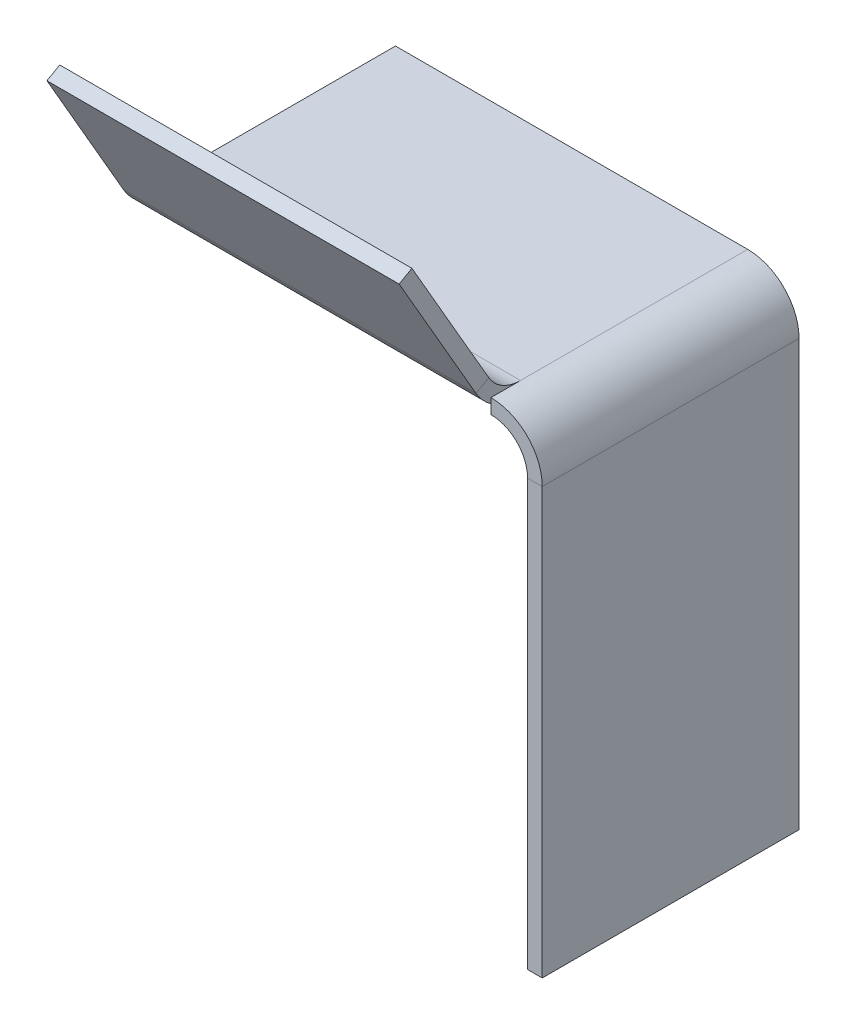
ISO-10303-21;
HEADER;
FILE_DESCRIPTION(('STEP AP214'),'2;1');
FILE_NAME('part.step','',(''),(''),'','','');
FILE_SCHEMA(('AUTOMOTIVE_DESIGN { 1 0 10303 214 1 1 1 1 }'));
ENDSEC;
DATA;
#1=APPLICATION_CONTEXT('core data for automotive mechanical design processes');
#2=APPLICATION_PROTOCOL_DEFINITION('international standard','automotive_design',2000,#1);
#3=PRODUCT_CONTEXT('',#1,'mechanical');
#4=PRODUCT('Part','Part','',(#3));
#5=PRODUCT_RELATED_PRODUCT_CATEGORY('part','',(#4));
#6=PRODUCT_DEFINITION_FORMATION('','',#4);
#7=PRODUCT_DEFINITION_CONTEXT('part definition',#1,'design');
#8=PRODUCT_DEFINITION('design','',#6,#7);
#9=PRODUCT_DEFINITION_SHAPE('','',#8);
#10=(LENGTH_UNIT() NAMED_UNIT(*) SI_UNIT(.MILLI.,.METRE.));
#11=(NAMED_UNIT(*) PLANE_ANGLE_UNIT() SI_UNIT($,.RADIAN.));
#12=(NAMED_UNIT(*) SI_UNIT($,.STERADIAN.) SOLID_ANGLE_UNIT());
#13=UNCERTAINTY_MEASURE_WITH_UNIT(LENGTH_MEASURE(1.E-05),#10,'distance_accuracy_value','');
#14=(GEOMETRIC_REPRESENTATION_CONTEXT(3) GLOBAL_UNCERTAINTY_ASSIGNED_CONTEXT((#13)) GLOBAL_UNIT_ASSIGNED_CONTEXT((#10,
#11,#12)) REPRESENTATION_CONTEXT('',''));
#15=CARTESIAN_POINT('',(0.,0.,0.));
#16=DIRECTION('',(0.,0.,1.));
#17=DIRECTION('',(1.,0.,0.));
#18=AXIS2_PLACEMENT_3D('',#15,#16,#17);
#19=CARTESIAN_POINT('',(-7.,65.,35.));
#20=DIRECTION('',(-1.,0.,0.));
#21=DIRECTION('',(0.,0.,1.));
#22=AXIS2_PLACEMENT_3D('',#19,#20,#21);
#23=PLANE('',#22);
#24=DIRECTION('',(0.,1.,0.));
#25=VECTOR('',#24,1.);
#26=CARTESIAN_POINT('',(-7.,63.,35.));
#27=LINE('',#26,#25);
#28=CARTESIAN_POINT('',(-7.,63.,35.));
#29=VERTEX_POINT('',#28);
#30=CARTESIAN_POINT('',(-7.,64.2845239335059,35.));
#31=VERTEX_POINT('',#30);
#32=EDGE_CURVE('E279',#29,#31,#27,.T.);
#33=ORIENTED_EDGE('',*,*,#32,.T.);
#34=CARTESIAN_POINT('',(-7.,70.,30.9585481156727));
#35=DIRECTION('',(1.,0.,0.));
#36=DIRECTION('',(0.,0.,-1.));
#37=AXIS2_PLACEMENT_3D('',#34,#35,#36);
#38=CIRCLE('',#37,7.);
#39=CARTESIAN_POINT('',(-7.,63.,30.9585481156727));
#40=VERTEX_POINT('',#39);
#41=EDGE_CURVE('E13',#31,#40,#38,.T.);
#42=ORIENTED_EDGE('',*,*,#41,.T.);
#43=DIRECTION('',(0.,0.,-1.));
#44=VECTOR('',#43,1.);
#45=CARTESIAN_POINT('',(-7.,63.,35.));
#46=LINE('',#45,#44);
#47=EDGE_CURVE('E268',#29,#40,#46,.T.);
#48=ORIENTED_EDGE('',*,*,#47,.F.);
#49=EDGE_LOOP('',(#33,#42,#48));
#50=FACE_BOUND('',#49,.T.);
#51=ADVANCED_FACE('F56',(#50),#23,.T.);
#52=CARTESIAN_POINT('',(0.,65.,35.));
#53=DIRECTION('',(0.,-1.,0.));
#54=DIRECTION('',(0.,0.,-1.));
#55=AXIS2_PLACEMENT_3D('',#52,#53,#54);
#56=PLANE('',#55);
#57=DIRECTION('',(1.,0.,0.));
#58=VECTOR('',#57,1.);
#59=CARTESIAN_POINT('',(-7.,65.,30.9585481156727));
#60=LINE('',#59,#58);
#61=CARTESIAN_POINT('',(-7.,65.,30.9585481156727));
#62=VERTEX_POINT('',#61);
#63=CARTESIAN_POINT('',(-55.,65.,30.9585481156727));
#64=VERTEX_POINT('',#63);
#65=EDGE_CURVE('E208',#62,#64,#60,.F.);
#66=ORIENTED_EDGE('',*,*,#65,.F.);
#67=DIRECTION('',(0.,0.,-1.));
#68=VECTOR('',#67,1.);
#69=CARTESIAN_POINT('',(-7.,65.,35.));
#70=LINE('',#69,#68);
#71=CARTESIAN_POINT('',(-7.,65.,0.));
#72=VERTEX_POINT('',#71);
#73=EDGE_CURVE('E231',#62,#72,#70,.T.);
#74=ORIENTED_EDGE('',*,*,#73,.T.);
#75=DIRECTION('',(-1.,0.,0.));
#76=VECTOR('',#75,1.);
#77=CARTESIAN_POINT('',(0.,65.,0.));
#78=LINE('',#77,#76);
#79=CARTESIAN_POINT('',(-55.,65.,0.));
#80=VERTEX_POINT('',#79);
#81=EDGE_CURVE('E215',#72,#80,#78,.T.);
#82=ORIENTED_EDGE('',*,*,#81,.T.);
#83=DIRECTION('',(0.,0.,-1.));
#84=VECTOR('',#83,1.);
#85=CARTESIAN_POINT('',(-55.,65.,35.));
#86=LINE('',#85,#84);
#87=EDGE_CURVE('E273',#64,#80,#86,.T.);
#88=ORIENTED_EDGE('',*,*,#87,.F.);
#89=EDGE_LOOP('',(#66,#74,#82,#88));
#90=FACE_BOUND('',#89,.T.);
#91=ADVANCED_FACE('F323',(#90),#56,.F.);
#92=CARTESIAN_POINT('',(0.,63.,35.));
#93=DIRECTION('',(0.,-1.,0.));
#94=DIRECTION('',(0.,0.,-1.));
#95=AXIS2_PLACEMENT_3D('',#92,#93,#94);
#96=PLANE('',#95);
#97=CARTESIAN_POINT('',(-7.,63.,0.));
#98=VERTEX_POINT('',#97);
#99=EDGE_CURVE('E267',#40,#98,#46,.T.);
#100=ORIENTED_EDGE('',*,*,#99,.F.);
#101=DIRECTION('',(1.,0.,0.));
#102=VECTOR('',#101,1.);
#103=CARTESIAN_POINT('',(-7.,63.,30.9585481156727));
#104=LINE('',#103,#102);
#105=CARTESIAN_POINT('',(-55.,63.,30.9585481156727));
#106=VERTEX_POINT('',#105);
#107=EDGE_CURVE('E199',#40,#106,#104,.F.);
#108=ORIENTED_EDGE('',*,*,#107,.T.);
#109=DIRECTION('',(0.,0.,-1.));
#110=VECTOR('',#109,1.);
#111=CARTESIAN_POINT('',(-55.,63.,35.));
#112=LINE('',#111,#110);
#113=CARTESIAN_POINT('',(-55.,63.,0.));
#114=VERTEX_POINT('',#113);
#115=EDGE_CURVE('E271',#106,#114,#112,.T.);
#116=ORIENTED_EDGE('',*,*,#115,.T.);
#117=DIRECTION('',(1.,0.,0.));
#118=VECTOR('',#117,1.);
#119=CARTESIAN_POINT('',(0.,63.,0.));
#120=LINE('',#119,#118);
#121=EDGE_CURVE('E237',#98,#114,#120,.F.);
#122=ORIENTED_EDGE('',*,*,#121,.F.);
#123=EDGE_LOOP('',(#100,#108,#116,#122));
#124=FACE_BOUND('',#123,.T.);
#125=ADVANCED_FACE('F294',(#124),#96,.T.);
#126=CARTESIAN_POINT('',(0.,58.,35.));
#127=DIRECTION('',(0.,0.,1.));
#128=DIRECTION('',(1.,0.,0.));
#129=AXIS2_PLACEMENT_3D('',#126,#127,#128);
#130=PLANE('',#129);
#131=DIRECTION('',(-1.,0.,0.));
#132=VECTOR('',#131,1.);
#133=CARTESIAN_POINT('',(0.,58.,35.));
#134=LINE('',#133,#132);
#135=CARTESIAN_POINT('',(0.,58.,35.));
#136=VERTEX_POINT('',#135);
#137=CARTESIAN_POINT('',(-2.,58.,35.));
#138=VERTEX_POINT('',#137);
#139=EDGE_CURVE('E60',#136,#138,#134,.T.);
#140=ORIENTED_EDGE('',*,*,#139,.F.);
#141=CARTESIAN_POINT('',(-7.,58.,35.));
#142=DIRECTION('',(0.,0.,-1.));
#143=DIRECTION('',(-1.,0.,0.));
#144=AXIS2_PLACEMENT_3D('',#141,#142,#143);
#145=CIRCLE('',#144,7.);
#146=CARTESIAN_POINT('',(-7.,65.,35.));
#147=VERTEX_POINT('',#146);
#148=EDGE_CURVE('E229',#136,#147,#145,.F.);
#149=ORIENTED_EDGE('',*,*,#148,.T.);
#150=EDGE_CURVE('E73',#31,#147,#27,.T.);
#151=ORIENTED_EDGE('',*,*,#150,.F.);
#152=ORIENTED_EDGE('',*,*,#32,.F.);
#153=CARTESIAN_POINT('',(-7.,58.,35.));
#154=DIRECTION('',(0.,0.,1.));
#155=DIRECTION('',(1.,0.,0.));
#156=AXIS2_PLACEMENT_3D('',#153,#154,#155);
#157=CIRCLE('',#156,5.);
#158=EDGE_CURVE('E216',#138,#29,#157,.T.);
#159=ORIENTED_EDGE('',*,*,#158,.F.);
#160=EDGE_LOOP('',(#140,#149,#151,#152,#159));
#161=FACE_BOUND('',#160,.T.);
#162=ADVANCED_FACE('F58',(#161),#130,.T.);
#163=CARTESIAN_POINT('',(-7.,63.,35.));
#164=DIRECTION('',(0.,0.,1.));
#165=DIRECTION('',(1.,0.,0.));
#166=AXIS2_PLACEMENT_3D('',#163,#164,#165);
#167=PLANE('',#166);
#168=DIRECTION('',(0.,1.,0.));
#169=VECTOR('',#168,1.);
#170=CARTESIAN_POINT('',(0.,0.,35.));
#171=LINE('',#170,#169);
#172=CARTESIAN_POINT('',(0.,0.,35.));
#173=VERTEX_POINT('',#172);
#174=EDGE_CURVE('E226',#173,#136,#171,.T.);
#175=ORIENTED_EDGE('',*,*,#174,.T.);
#176=ORIENTED_EDGE('',*,*,#139,.T.);
#177=DIRECTION('',(0.,1.,0.));
#178=VECTOR('',#177,1.);
#179=CARTESIAN_POINT('',(-2.,0.,35.));
#180=LINE('',#179,#178);
#181=CARTESIAN_POINT('',(-2.,0.,35.));
#182=VERTEX_POINT('',#181);
#183=EDGE_CURVE('E219',#182,#138,#180,.T.);
#184=ORIENTED_EDGE('',*,*,#183,.F.);
#185=DIRECTION('',(-1.,0.,0.));
#186=VECTOR('',#185,1.);
#187=CARTESIAN_POINT('',(0.,0.,35.));
#188=LINE('',#187,#186);
#189=EDGE_CURVE('E223',#173,#182,#188,.T.);
#190=ORIENTED_EDGE('',*,*,#189,.F.);
#191=EDGE_LOOP('',(#175,#176,#184,#190));
#192=FACE_BOUND('',#191,.T.);
#193=ADVANCED_FACE('F306',(#192),#167,.T.);
#194=CARTESIAN_POINT('',(-7.,65.,0.));
#195=DIRECTION('',(0.,0.,-1.));
#196=DIRECTION('',(-1.,0.,0.));
#197=AXIS2_PLACEMENT_3D('',#194,#195,#196);
#198=PLANE('',#197);
#199=DIRECTION('',(0.,-1.,0.));
#200=VECTOR('',#199,1.);
#201=CARTESIAN_POINT('',(-7.,65.,0.));
#202=LINE('',#201,#200);
#203=EDGE_CURVE('E277',#72,#98,#202,.T.);
#204=ORIENTED_EDGE('',*,*,#203,.F.);
#205=CARTESIAN_POINT('',(-7.,58.,0.));
#206=DIRECTION('',(0.,0.,-1.));
#207=DIRECTION('',(-1.,0.,0.));
#208=AXIS2_PLACEMENT_3D('',#205,#206,#207);
#209=CIRCLE('',#208,7.);
#210=CARTESIAN_POINT('',(0.,58.,0.));
#211=VERTEX_POINT('',#210);
#212=EDGE_CURVE('E220',#211,#72,#209,.F.);
#213=ORIENTED_EDGE('',*,*,#212,.F.);
#214=DIRECTION('',(1.,0.,0.));
#215=VECTOR('',#214,1.);
#216=CARTESIAN_POINT('',(-2.,58.,0.));
#217=LINE('',#216,#215);
#218=CARTESIAN_POINT('',(-2.,58.,0.));
#219=VERTEX_POINT('',#218);
#220=EDGE_CURVE('E275',#219,#211,#217,.T.);
#221=ORIENTED_EDGE('',*,*,#220,.F.);
#222=CARTESIAN_POINT('',(-7.,58.,0.));
#223=DIRECTION('',(0.,0.,1.));
#224=DIRECTION('',(1.,0.,0.));
#225=AXIS2_PLACEMENT_3D('',#222,#223,#224);
#226=CIRCLE('',#225,5.);
#227=EDGE_CURVE('E240',#219,#98,#226,.T.);
#228=ORIENTED_EDGE('',*,*,#227,.T.);
#229=EDGE_LOOP('',(#204,#213,#221,#228));
#230=FACE_BOUND('',#229,.T.);
#231=ADVANCED_FACE('F366',(#230),#198,.T.);
#232=CARTESIAN_POINT('',(-2.,58.,0.));
#233=DIRECTION('',(0.,0.,-1.));
#234=DIRECTION('',(-1.,0.,0.));
#235=AXIS2_PLACEMENT_3D('',#232,#233,#234);
#236=PLANE('',#235);
#237=ORIENTED_EDGE('',*,*,#81,.F.);
#238=ORIENTED_EDGE('',*,*,#203,.T.);
#239=ORIENTED_EDGE('',*,*,#121,.T.);
#240=DIRECTION('',(0.,1.,0.));
#241=VECTOR('',#240,1.);
#242=CARTESIAN_POINT('',(-55.,63.,0.));
#243=LINE('',#242,#241);
#244=EDGE_CURVE('E234',#114,#80,#243,.T.);
#245=ORIENTED_EDGE('',*,*,#244,.T.);
#246=EDGE_LOOP('',(#237,#238,#239,#245));
#247=FACE_BOUND('',#246,.T.);
#248=ADVANCED_FACE('F362',(#247),#236,.T.);
#249=CARTESIAN_POINT('',(-55.,63.,35.));
#250=DIRECTION('',(-1.,0.,0.));
#251=DIRECTION('',(0.,0.,1.));
#252=AXIS2_PLACEMENT_3D('',#249,#250,#251);
#253=PLANE('',#252);
#254=DIRECTION('',(0.,-1.,0.));
#255=VECTOR('',#254,1.);
#256=CARTESIAN_POINT('',(-55.,65.,30.9585481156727));
#257=LINE('',#256,#255);
#258=EDGE_CURVE('E81',#64,#106,#257,.T.);
#259=ORIENTED_EDGE('',*,*,#258,.F.);
#260=ORIENTED_EDGE('',*,*,#87,.T.);
#261=ORIENTED_EDGE('',*,*,#244,.F.);
#262=ORIENTED_EDGE('',*,*,#115,.F.);
#263=EDGE_LOOP('',(#259,#260,#261,#262));
#264=FACE_BOUND('',#263,.T.);
#265=ADVANCED_FACE('F358',(#264),#253,.T.);
#266=CARTESIAN_POINT('',(-7.,58.,35.));
#267=DIRECTION('',(0.,0.,-1.));
#268=DIRECTION('',(-1.,0.,0.));
#269=AXIS2_PLACEMENT_3D('',#266,#267,#268);
#270=CYLINDRICAL_SURFACE('',#269,5.);
#271=ORIENTED_EDGE('',*,*,#227,.F.);
#272=DIRECTION('',(0.,0.,-1.));
#273=VECTOR('',#272,1.);
#274=CARTESIAN_POINT('',(-2.,58.,35.));
#275=LINE('',#274,#273);
#276=EDGE_CURVE('E264',#138,#219,#275,.T.);
#277=ORIENTED_EDGE('',*,*,#276,.F.);
#278=ORIENTED_EDGE('',*,*,#158,.T.);
#279=ORIENTED_EDGE('',*,*,#47,.T.);
#280=ORIENTED_EDGE('',*,*,#99,.T.);
#281=EDGE_LOOP('',(#271,#277,#278,#279,#280));
#282=FACE_BOUND('',#281,.T.);
#283=ADVANCED_FACE('F297',(#282),#270,.F.);
#284=CARTESIAN_POINT('',(-2.,0.,35.));
#285=DIRECTION('',(-1.,0.,0.));
#286=DIRECTION('',(0.,0.,1.));
#287=AXIS2_PLACEMENT_3D('',#284,#285,#286);
#288=PLANE('',#287);
#289=DIRECTION('',(0.,1.,0.));
#290=VECTOR('',#289,1.);
#291=CARTESIAN_POINT('',(-2.,0.,0.));
#292=LINE('',#291,#290);
#293=CARTESIAN_POINT('',(-2.,0.,0.));
#294=VERTEX_POINT('',#293);
#295=EDGE_CURVE('E243',#294,#219,#292,.T.);
#296=ORIENTED_EDGE('',*,*,#295,.F.);
#297=DIRECTION('',(0.,0.,-1.));
#298=VECTOR('',#297,1.);
#299=CARTESIAN_POINT('',(-2.,0.,35.));
#300=LINE('',#299,#298);
#301=EDGE_CURVE('E262',#182,#294,#300,.T.);
#302=ORIENTED_EDGE('',*,*,#301,.F.);
#303=ORIENTED_EDGE('',*,*,#183,.T.);
#304=ORIENTED_EDGE('',*,*,#276,.T.);
#305=EDGE_LOOP('',(#296,#302,#303,#304));
#306=FACE_BOUND('',#305,.T.);
#307=ADVANCED_FACE('F303',(#306),#288,.T.);
#308=CARTESIAN_POINT('',(0.,0.,35.));
#309=DIRECTION('',(0.,-1.,0.));
#310=DIRECTION('',(0.,0.,-1.));
#311=AXIS2_PLACEMENT_3D('',#308,#309,#310);
#312=PLANE('',#311);
#313=DIRECTION('',(-1.,0.,0.));
#314=VECTOR('',#313,1.);
#315=CARTESIAN_POINT('',(0.,0.,0.));
#316=LINE('',#315,#314);
#317=CARTESIAN_POINT('',(0.,0.,0.));
#318=VERTEX_POINT('',#317);
#319=EDGE_CURVE('E246',#318,#294,#316,.T.);
#320=ORIENTED_EDGE('',*,*,#319,.F.);
#321=DIRECTION('',(0.,0.,-1.));
#322=VECTOR('',#321,1.);
#323=CARTESIAN_POINT('',(0.,0.,35.));
#324=LINE('',#323,#322);
#325=EDGE_CURVE('E260',#173,#318,#324,.T.);
#326=ORIENTED_EDGE('',*,*,#325,.F.);
#327=ORIENTED_EDGE('',*,*,#189,.T.);
#328=ORIENTED_EDGE('',*,*,#301,.T.);
#329=EDGE_LOOP('',(#320,#326,#327,#328));
#330=FACE_BOUND('',#329,.T.);
#331=ADVANCED_FACE('F309',(#330),#312,.T.);
#332=CARTESIAN_POINT('',(0.,0.,35.));
#333=DIRECTION('',(-1.,0.,0.));
#334=DIRECTION('',(0.,0.,1.));
#335=AXIS2_PLACEMENT_3D('',#332,#333,#334);
#336=PLANE('',#335);
#337=DIRECTION('',(0.,1.,0.));
#338=VECTOR('',#337,1.);
#339=CARTESIAN_POINT('',(0.,0.,0.));
#340=LINE('',#339,#338);
#341=EDGE_CURVE('E249',#318,#211,#340,.T.);
#342=ORIENTED_EDGE('',*,*,#341,.T.);
#343=DIRECTION('',(0.,0.,-1.));
#344=VECTOR('',#343,1.);
#345=CARTESIAN_POINT('',(0.,58.,35.));
#346=LINE('',#345,#344);
#347=EDGE_CURVE('E257',#136,#211,#346,.T.);
#348=ORIENTED_EDGE('',*,*,#347,.F.);
#349=ORIENTED_EDGE('',*,*,#174,.F.);
#350=ORIENTED_EDGE('',*,*,#325,.T.);
#351=EDGE_LOOP('',(#342,#348,#349,#350));
#352=FACE_BOUND('',#351,.T.);
#353=ADVANCED_FACE('F314',(#352),#336,.F.);
#354=CARTESIAN_POINT('',(-7.,58.,35.));
#355=DIRECTION('',(0.,0.,-1.));
#356=DIRECTION('',(-1.,0.,0.));
#357=AXIS2_PLACEMENT_3D('',#354,#355,#356);
#358=CYLINDRICAL_SURFACE('',#357,7.);
#359=ORIENTED_EDGE('',*,*,#212,.T.);
#360=ORIENTED_EDGE('',*,*,#73,.F.);
#361=EDGE_CURVE('E254',#147,#62,#70,.T.);
#362=ORIENTED_EDGE('',*,*,#361,.F.);
#363=ORIENTED_EDGE('',*,*,#148,.F.);
#364=ORIENTED_EDGE('',*,*,#347,.T.);
#365=EDGE_LOOP('',(#359,#360,#362,#363,#364));
#366=FACE_BOUND('',#365,.T.);
#367=ADVANCED_FACE('F318',(#366),#358,.T.);
#368=CARTESIAN_POINT('',(-7.,58.,0.));
#369=DIRECTION('',(0.,0.,1.));
#370=DIRECTION('',(1.,0.,0.));
#371=AXIS2_PLACEMENT_3D('',#368,#369,#370);
#372=PLANE('',#371);
#373=ORIENTED_EDGE('',*,*,#295,.T.);
#374=ORIENTED_EDGE('',*,*,#220,.T.);
#375=ORIENTED_EDGE('',*,*,#341,.F.);
#376=ORIENTED_EDGE('',*,*,#319,.T.);
#377=EDGE_LOOP('',(#373,#374,#375,#376));
#378=FACE_BOUND('',#377,.T.);
#379=ADVANCED_FACE('F331',(#378),#372,.F.);
#380=CARTESIAN_POINT('',(-55.,70.,30.9585481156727));
#381=DIRECTION('',(-1.,0.,0.));
#382=DIRECTION('',(0.,0.,1.));
#383=AXIS2_PLACEMENT_3D('',#380,#381,#382);
#384=PLANE('',#383);
#385=DIRECTION('',(0.,0.500000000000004,-0.866025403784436));
#386=VECTOR('',#385,1.);
#387=CARTESIAN_POINT('',(-55.,66.5,37.0207259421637));
#388=LINE('',#387,#386);
#389=CARTESIAN_POINT('',(-55.,67.5,35.2886751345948));
#390=VERTEX_POINT('',#389);
#391=CARTESIAN_POINT('',(-55.,66.5,37.0207259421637));
#392=VERTEX_POINT('',#391);
#393=EDGE_CURVE('E181',#390,#392,#388,.F.);
#394=ORIENTED_EDGE('',*,*,#393,.F.);
#395=CARTESIAN_POINT('',(-55.,70.,30.9585481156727));
#396=DIRECTION('',(1.,0.,0.));
#397=DIRECTION('',(0.,0.,-1.));
#398=AXIS2_PLACEMENT_3D('',#395,#396,#397);
#399=CIRCLE('',#398,5.);
#400=EDGE_CURVE('E205',#64,#390,#399,.F.);
#401=ORIENTED_EDGE('',*,*,#400,.F.);
#402=ORIENTED_EDGE('',*,*,#258,.T.);
#403=CARTESIAN_POINT('',(-55.,70.,30.9585481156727));
#404=DIRECTION('',(1.,0.,0.));
#405=DIRECTION('',(0.,0.,-1.));
#406=AXIS2_PLACEMENT_3D('',#403,#404,#405);
#407=CIRCLE('',#406,7.);
#408=EDGE_CURVE('E201',#106,#392,#407,.F.);
#409=ORIENTED_EDGE('',*,*,#408,.T.);
#410=EDGE_LOOP('',(#394,#401,#402,#409));
#411=FACE_BOUND('',#410,.T.);
#412=ADVANCED_FACE('F329',(#411),#384,.T.);
#413=CARTESIAN_POINT('',(-7.,70.,30.9585481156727));
#414=DIRECTION('',(-1.,0.,0.));
#415=DIRECTION('',(0.,0.,1.));
#416=AXIS2_PLACEMENT_3D('',#413,#414,#415);
#417=PLANE('',#416);
#418=CARTESIAN_POINT('',(-7.,66.5,37.0207259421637));
#419=VERTEX_POINT('',#418);
#420=EDGE_CURVE('E66',#419,#31,#38,.T.);
#421=ORIENTED_EDGE('',*,*,#420,.T.);
#422=ORIENTED_EDGE('',*,*,#150,.T.);
#423=ORIENTED_EDGE('',*,*,#361,.T.);
#424=CARTESIAN_POINT('',(-7.,70.,30.9585481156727));
#425=DIRECTION('',(1.,0.,0.));
#426=DIRECTION('',(0.,0.,-1.));
#427=AXIS2_PLACEMENT_3D('',#424,#425,#426);
#428=CIRCLE('',#427,5.);
#429=CARTESIAN_POINT('',(-7.,67.5,35.2886751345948));
#430=VERTEX_POINT('',#429);
#431=EDGE_CURVE('E211',#430,#62,#428,.T.);
#432=ORIENTED_EDGE('',*,*,#431,.F.);
#433=DIRECTION('',(0.,0.500000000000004,-0.866025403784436));
#434=VECTOR('',#433,1.);
#435=CARTESIAN_POINT('',(-7.,67.5,35.2886751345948));
#436=LINE('',#435,#434);
#437=EDGE_CURVE('E193',#430,#419,#436,.F.);
#438=ORIENTED_EDGE('',*,*,#437,.T.);
#439=EDGE_LOOP('',(#421,#422,#423,#432,#438));
#440=FACE_BOUND('',#439,.T.);
#441=ADVANCED_FACE('F284',(#440),#417,.F.);
#442=CARTESIAN_POINT('',(-7.,70.,30.9585481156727));
#443=DIRECTION('',(1.,0.,0.));
#444=DIRECTION('',(0.,-0.500000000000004,0.866025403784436));
#445=AXIS2_PLACEMENT_3D('',#442,#443,#444);
#446=CYLINDRICAL_SURFACE('',#445,7.);
#447=ORIENTED_EDGE('',*,*,#107,.F.);
#448=ORIENTED_EDGE('',*,*,#41,.F.);
#449=ORIENTED_EDGE('',*,*,#420,.F.);
#450=DIRECTION('',(1.,0.,0.));
#451=VECTOR('',#450,1.);
#452=CARTESIAN_POINT('',(-55.,66.5,37.0207259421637));
#453=LINE('',#452,#451);
#454=EDGE_CURVE('E191',#419,#392,#453,.F.);
#455=ORIENTED_EDGE('',*,*,#454,.T.);
#456=ORIENTED_EDGE('',*,*,#408,.F.);
#457=EDGE_LOOP('',(#447,#448,#449,#455,#456));
#458=FACE_BOUND('',#457,.T.);
#459=ADVANCED_FACE('F289',(#458),#446,.T.);
#460=CARTESIAN_POINT('',(-7.,70.,30.9585481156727));
#461=DIRECTION('',(1.,0.,0.));
#462=DIRECTION('',(0.,-0.500000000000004,0.866025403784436));
#463=AXIS2_PLACEMENT_3D('',#460,#461,#462);
#464=CYLINDRICAL_SURFACE('',#463,5.);
#465=ORIENTED_EDGE('',*,*,#65,.T.);
#466=ORIENTED_EDGE('',*,*,#400,.T.);
#467=DIRECTION('',(1.,0.,0.));
#468=VECTOR('',#467,1.);
#469=CARTESIAN_POINT('',(-55.,67.5,35.2886751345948));
#470=LINE('',#469,#468);
#471=EDGE_CURVE('E196',#390,#430,#470,.T.);
#472=ORIENTED_EDGE('',*,*,#471,.T.);
#473=ORIENTED_EDGE('',*,*,#431,.T.);
#474=EDGE_LOOP('',(#465,#466,#472,#473));
#475=FACE_BOUND('',#474,.T.);
#476=ADVANCED_FACE('F326',(#475),#464,.F.);
#477=CARTESIAN_POINT('',(-7.,84.6506350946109,47.5000000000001));
#478=DIRECTION('',(-1.,0.,0.));
#479=DIRECTION('',(0.,0.,1.));
#480=AXIS2_PLACEMENT_3D('',#477,#478,#479);
#481=PLANE('',#480);
#482=ORIENTED_EDGE('',*,*,#437,.F.);
#483=DIRECTION('',(0.,-0.866025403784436,-0.500000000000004));
#484=VECTOR('',#483,1.);
#485=CARTESIAN_POINT('',(-7.,85.6506350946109,45.7679491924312));
#486=LINE('',#485,#484);
#487=CARTESIAN_POINT('',(-7.,85.6506350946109,45.7679491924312));
#488=VERTEX_POINT('',#487);
#489=EDGE_CURVE('E189',#430,#488,#486,.F.);
#490=ORIENTED_EDGE('',*,*,#489,.T.);
#491=DIRECTION('',(0.,0.500000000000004,-0.866025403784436));
#492=VECTOR('',#491,1.);
#493=CARTESIAN_POINT('',(-7.,84.6506350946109,47.5000000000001));
#494=LINE('',#493,#492);
#495=CARTESIAN_POINT('',(-7.,84.6506350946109,47.5000000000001));
#496=VERTEX_POINT('',#495);
#497=EDGE_CURVE('E177',#496,#488,#494,.T.);
#498=ORIENTED_EDGE('',*,*,#497,.F.);
#499=DIRECTION('',(0.,0.866025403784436,0.500000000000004));
#500=VECTOR('',#499,1.);
#501=CARTESIAN_POINT('',(-7.,0.0945554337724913,-1.31847535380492));
#502=LINE('',#501,#500);
#503=EDGE_CURVE('E164',#419,#496,#502,.T.);
#504=ORIENTED_EDGE('',*,*,#503,.F.);
#505=EDGE_LOOP('',(#482,#490,#498,#504));
#506=FACE_BOUND('',#505,.T.);
#507=ADVANCED_FACE('F507',(#506),#481,.F.);
#508=CARTESIAN_POINT('',(-55.,64.,35.5773502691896));
#509=DIRECTION('',(1.,0.,0.));
#510=DIRECTION('',(0.,0.,-1.));
#511=AXIS2_PLACEMENT_3D('',#508,#509,#510);
#512=PLANE('',#511);
#513=ORIENTED_EDGE('',*,*,#393,.T.);
#514=DIRECTION('',(0.,-0.866025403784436,-0.500000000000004));
#515=VECTOR('',#514,1.);
#516=CARTESIAN_POINT('',(-55.,0.0945554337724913,-1.31847535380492));
#517=LINE('',#516,#515);
#518=CARTESIAN_POINT('',(-55.,84.6506350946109,47.5000000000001));
#519=VERTEX_POINT('',#518);
#520=EDGE_CURVE('E162',#519,#392,#517,.T.);
#521=ORIENTED_EDGE('',*,*,#520,.F.);
#522=DIRECTION('',(0.,0.500000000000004,-0.866025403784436));
#523=VECTOR('',#522,1.);
#524=CARTESIAN_POINT('',(-55.,84.6506350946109,47.5000000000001));
#525=LINE('',#524,#523);
#526=CARTESIAN_POINT('',(-55.,85.6506350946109,45.7679491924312));
#527=VERTEX_POINT('',#526);
#528=EDGE_CURVE('E170',#519,#527,#525,.T.);
#529=ORIENTED_EDGE('',*,*,#528,.T.);
#530=DIRECTION('',(0.,0.866025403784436,0.500000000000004));
#531=VECTOR('',#530,1.);
#532=CARTESIAN_POINT('',(-55.,65.,33.8452994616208));
#533=LINE('',#532,#531);
#534=EDGE_CURVE('E186',#527,#390,#533,.F.);
#535=ORIENTED_EDGE('',*,*,#534,.T.);
#536=EDGE_LOOP('',(#513,#521,#529,#535));
#537=FACE_BOUND('',#536,.T.);
#538=ADVANCED_FACE('F180',(#537),#512,.F.);
#539=CARTESIAN_POINT('',(0.,0.0945554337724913,-1.31847535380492));
#540=DIRECTION('',(0.,0.500000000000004,-0.866025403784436));
#541=DIRECTION('',(0.,0.866025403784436,0.500000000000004));
#542=AXIS2_PLACEMENT_3D('',#539,#540,#541);
#543=PLANE('',#542);
#544=ORIENTED_EDGE('',*,*,#454,.F.);
#545=ORIENTED_EDGE('',*,*,#503,.T.);
#546=DIRECTION('',(-1.,0.,0.));
#547=VECTOR('',#546,1.);
#548=CARTESIAN_POINT('',(0.,84.6506350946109,47.5000000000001));
#549=LINE('',#548,#547);
#550=EDGE_CURVE('E157',#496,#519,#549,.T.);
#551=ORIENTED_EDGE('',*,*,#550,.T.);
#552=ORIENTED_EDGE('',*,*,#520,.T.);
#553=EDGE_LOOP('',(#544,#545,#551,#552));
#554=FACE_BOUND('',#553,.T.);
#555=ADVANCED_FACE('F160',(#554),#543,.F.);
#556=CARTESIAN_POINT('',(0.,1.0945554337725,-3.05052616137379));
#557=DIRECTION('',(0.,0.500000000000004,-0.866025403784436));
#558=DIRECTION('',(0.,0.866025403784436,0.500000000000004));
#559=AXIS2_PLACEMENT_3D('',#556,#557,#558);
#560=PLANE('',#559);
#561=ORIENTED_EDGE('',*,*,#489,.F.);
#562=ORIENTED_EDGE('',*,*,#471,.F.);
#563=ORIENTED_EDGE('',*,*,#534,.F.);
#564=DIRECTION('',(1.,0.,0.));
#565=VECTOR('',#564,1.);
#566=CARTESIAN_POINT('',(-55.,85.6506350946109,45.7679491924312));
#567=LINE('',#566,#565);
#568=EDGE_CURVE('E173',#488,#527,#567,.F.);
#569=ORIENTED_EDGE('',*,*,#568,.F.);
#570=EDGE_LOOP('',(#561,#562,#563,#569));
#571=FACE_BOUND('',#570,.T.);
#572=ADVANCED_FACE('F535',(#571),#560,.T.);
#573=CARTESIAN_POINT('',(-55.,84.6506350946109,47.5000000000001));
#574=DIRECTION('',(0.,-0.866025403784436,-0.500000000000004));
#575=DIRECTION('',(0.,0.500000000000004,-0.866025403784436));
#576=AXIS2_PLACEMENT_3D('',#573,#574,#575);
#577=PLANE('',#576);
#578=ORIENTED_EDGE('',*,*,#568,.T.);
#579=ORIENTED_EDGE('',*,*,#528,.F.);
#580=ORIENTED_EDGE('',*,*,#550,.F.);
#581=ORIENTED_EDGE('',*,*,#497,.T.);
#582=EDGE_LOOP('',(#578,#579,#580,#581));
#583=FACE_BOUND('',#582,.T.);
#584=ADVANCED_FACE('F171',(#583),#577,.F.);
#585=CLOSED_SHELL('',(#51,#91,#125,#162,#193,#231,#248,#265,#283,#307,#331,#353,#367,#379,#412,
#441,#459,#476,#507,#538,#555,#572,#584));
#586=MANIFOLD_SOLID_BREP('B2',#585);
#587=ADVANCED_BREP_SHAPE_REPRESENTATION('',(#18,#586),#14);
#588=SHAPE_DEFINITION_REPRESENTATION(#9,#587);
ENDSEC;
END-ISO-10303-21;
